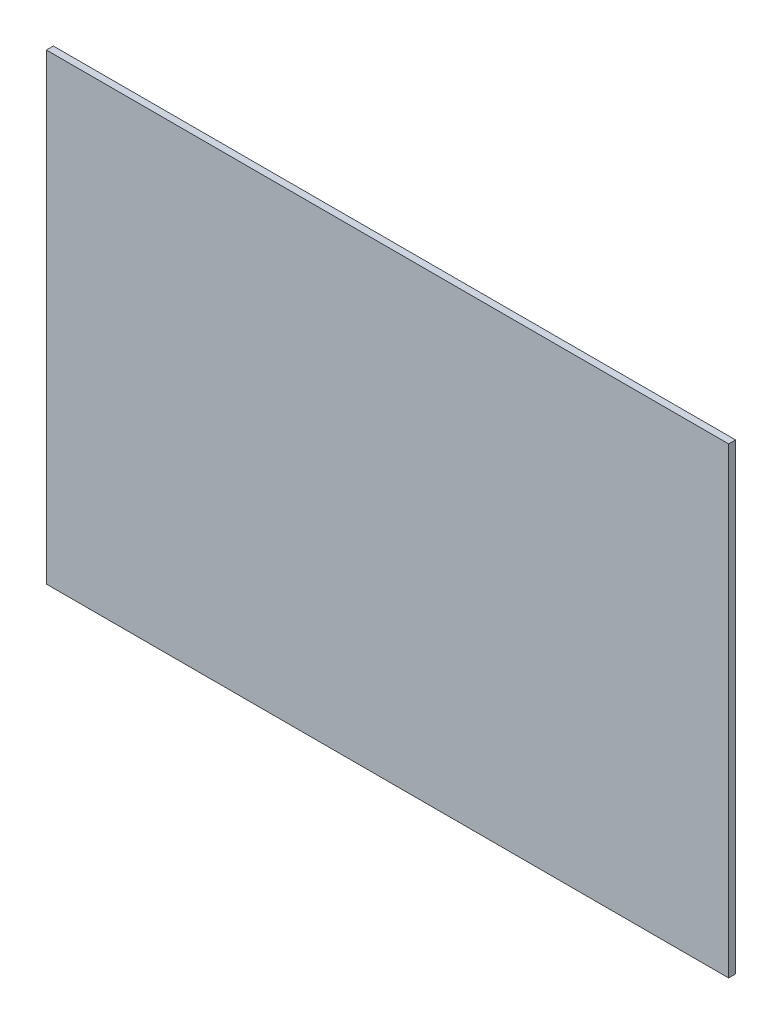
from build123d import *

# Parameters (mm, degrees)
SKETCH1_W           = 295
SKETCH1_H           = 200
BOSS_EXTRUDE1_DEPTH = 3


with BuildPart() as part:
    # Sketch1 → Boss-Extrude1 (new body)
    with BuildSketch(Plane.XY):
        Rectangle(SKETCH1_W, SKETCH1_H)
    extrude(amount=BOSS_EXTRUDE1_DEPTH)


solid = part.part
